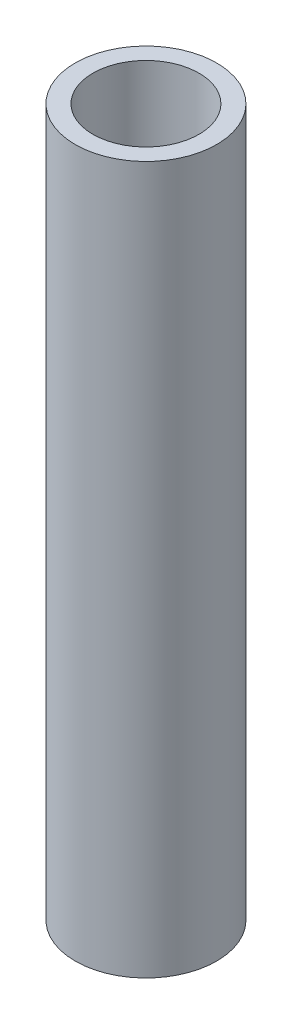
from build123d import *

# Parameters (mm, degrees)
ESQUISSE1_R        = 20
ESQUISSE1_R_2      = 15
BOSS_EXTRU_1_DEPTH = 200


with BuildPart() as part:
    # Esquisse1 → Boss.-Extru.1 (new body)
    with BuildSketch(Plane(origin=(0, 0, 0), x_dir=(1, 0, 0), z_dir=(0, 1, 0))):
        with Locations(Location((0, 0, 0), (0, 0, 270))):
            Circle(ESQUISSE1_R)
        with Locations(Location((0, 0, 0), (0, 0, 270))):
            Circle(ESQUISSE1_R_2, mode=Mode.SUBTRACT)
    extrude(amount=BOSS_EXTRU_1_DEPTH)


solid = part.part
